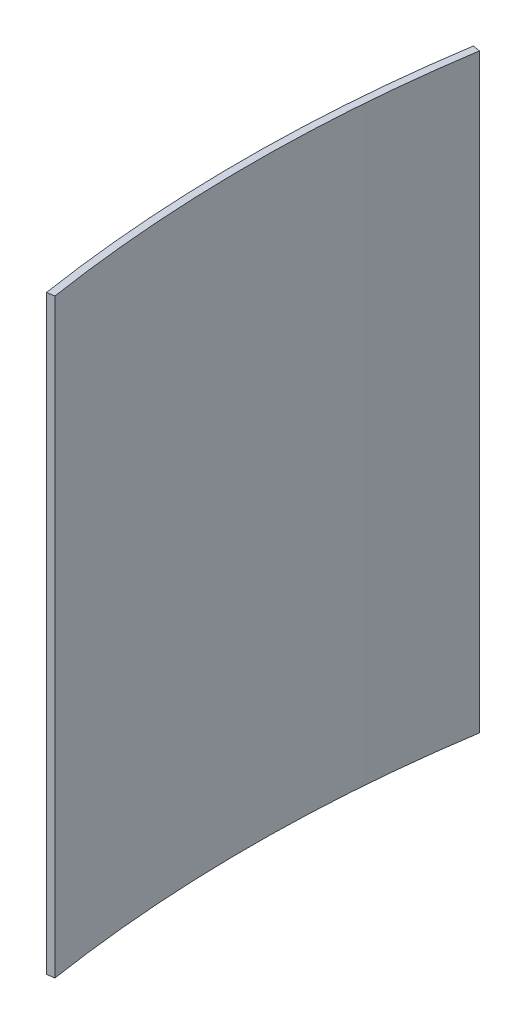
from build123d import *

# Parameters (mm, degrees)
LINEAR_AUSTRAGEN1_DEPTH = 320


with BuildPart() as part:
    # Skizze1 → Linear austragen1 (new body)
    with BuildSketch(Plane(origin=(0, 0, 0), x_dir=(1, 0, 0), z_dir=(0, 1, 0))):
        with BuildLine():
            Line((-741.130892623, 115), (-745.083590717, 115.613333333))
            ThreePointArc((-745.083590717, 115.613333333), (-754, 0), (-745.083590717, -115.613333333))
            Line((-745.083590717, -115.613333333), (-741.130892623, -115))
            ThreePointArc((-741.130892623, -115), (-750, 0), (-741.130892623, 115))
        make_face()
    extrude(amount=LINEAR_AUSTRAGEN1_DEPTH)


solid = part.part
